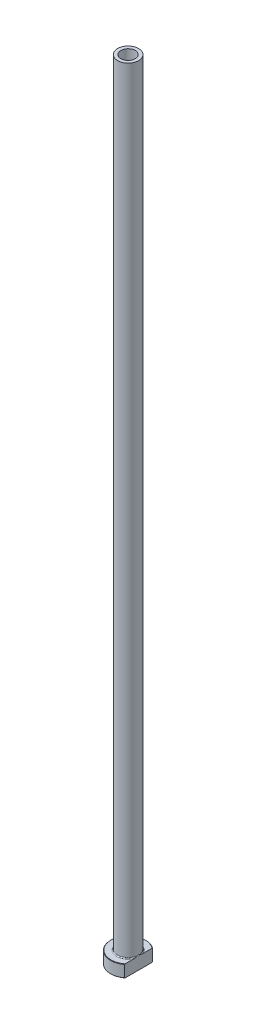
from build123d import *

# Parameters (mm, degrees)
FILLET1_R          = 0.5
CHAMFER1_SIZE      = 0.2
CUT_EXTRUDE1_DEPTH = 451.22216738
CHAMFER2_SIZE      = 0.5


with BuildPart() as part:
    # Sketch1 → Revolve1 (revolve)
    with BuildSketch(Plane.XY, mode=Mode.PRIVATE) as revolve1_sk:
        Polygon((-4.1, 450), (-6, 450), (-6, 7), (-10, 7), (-10, 0), (-4.35, 0), (-4.35, 393), (-4.1, 405), align=None)
    revolve(revolve1_sk.sketch.rotate(Axis((0, 92.187680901, 0), (0, -1, 0)), 270), axis=Axis((0, 92.187680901, 0), (0, -1, 0)))

    # Fillet1
    fillet1_edges = [part.edges().sort_by_distance(p)[0] for p in [
        (0, 7, -6),
    ]]
    fillet(fillet1_edges, radius=FILLET1_R)

    # Chamfer1
    chamfer1_edges = [part.edges().sort_by_distance(p)[0] for p in [
        (0, 0, -10),
        (0, 7, -10),
    ]]
    chamfer(chamfer1_edges, length=CHAMFER1_SIZE)

    # Sketch2 → Cut-Extrude1 (cut, through all)
    with BuildSketch(Plane.XZ):
        with BuildLine():
            Line((6, 8), (6, -8))
            ThreePointArc((6, -8), (10, 0), (6, 8))
        make_face()
    extrude(amount=-CUT_EXTRUDE1_DEPTH, mode=Mode.SUBTRACT)

    # Chamfer2
    chamfer2_edges = [part.edges().sort_by_distance(p)[0] for p in [
        (0, 0, -4.35),
    ]]
    chamfer(chamfer2_edges, length=CHAMFER2_SIZE)


solid = part.part
